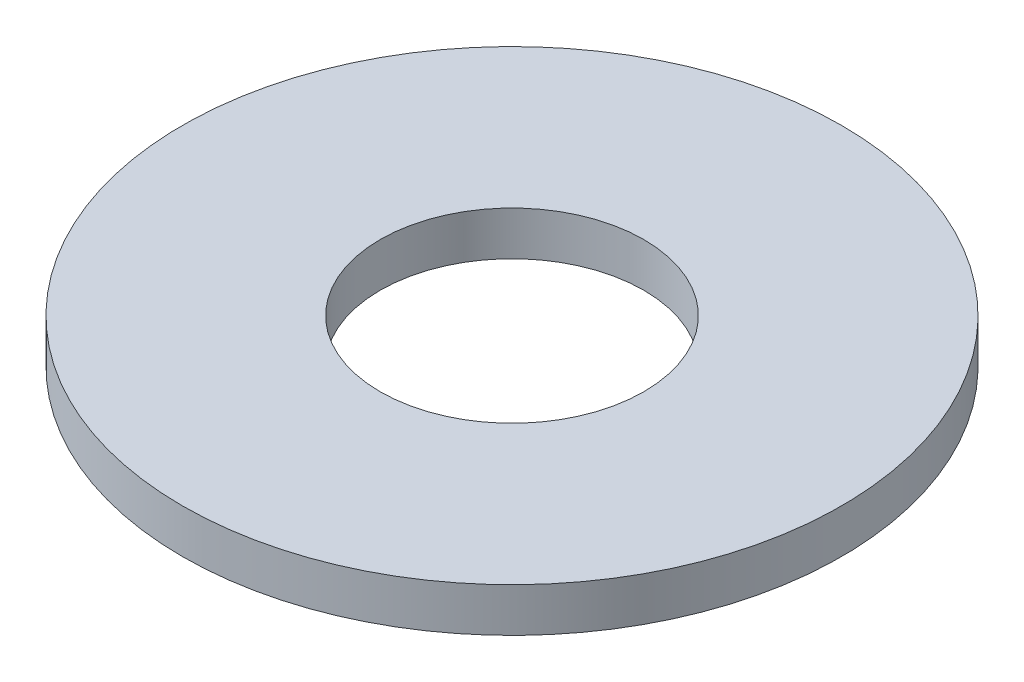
ISO-10303-21;
HEADER;
FILE_DESCRIPTION(('STEP AP214'),'2;1');
FILE_NAME('part.step','',(''),(''),'','','');
FILE_SCHEMA(('AUTOMOTIVE_DESIGN { 1 0 10303 214 1 1 1 1 }'));
ENDSEC;
DATA;
#1=APPLICATION_CONTEXT('core data for automotive mechanical design processes');
#2=APPLICATION_PROTOCOL_DEFINITION('international standard','automotive_design',2000,#1);
#3=PRODUCT_CONTEXT('',#1,'mechanical');
#4=PRODUCT('Part','Part','',(#3));
#5=PRODUCT_RELATED_PRODUCT_CATEGORY('part','',(#4));
#6=PRODUCT_DEFINITION_FORMATION('','',#4);
#7=PRODUCT_DEFINITION_CONTEXT('part definition',#1,'design');
#8=PRODUCT_DEFINITION('design','',#6,#7);
#9=PRODUCT_DEFINITION_SHAPE('','',#8);
#10=(LENGTH_UNIT() NAMED_UNIT(*) SI_UNIT(.MILLI.,.METRE.));
#11=(NAMED_UNIT(*) PLANE_ANGLE_UNIT() SI_UNIT($,.RADIAN.));
#12=(NAMED_UNIT(*) SI_UNIT($,.STERADIAN.) SOLID_ANGLE_UNIT());
#13=UNCERTAINTY_MEASURE_WITH_UNIT(LENGTH_MEASURE(1.E-05),#10,'distance_accuracy_value','');
#14=(GEOMETRIC_REPRESENTATION_CONTEXT(3) GLOBAL_UNCERTAINTY_ASSIGNED_CONTEXT((#13)) GLOBAL_UNIT_ASSIGNED_CONTEXT((#10,
#11,#12)) REPRESENTATION_CONTEXT('',''));
#15=CARTESIAN_POINT('',(0.,0.,0.));
#16=DIRECTION('',(0.,0.,1.));
#17=DIRECTION('',(1.,0.,0.));
#18=AXIS2_PLACEMENT_3D('',#15,#16,#17);
#19=CARTESIAN_POINT('',(0.,0.,0.));
#20=DIRECTION('',(0.,-1.,0.));
#21=DIRECTION('',(0.,0.,-1.));
#22=AXIS2_PLACEMENT_3D('',#19,#20,#21);
#23=CYLINDRICAL_SURFACE('',#22,6.);
#24=CARTESIAN_POINT('',(0.,2.,0.));
#25=DIRECTION('',(0.,-1.,0.));
#26=DIRECTION('',(0.,0.,-1.));
#27=AXIS2_PLACEMENT_3D('',#24,#25,#26);
#28=CIRCLE('',#27,6.);
#29=CARTESIAN_POINT('',(0.,2.,-6.));
#30=VERTEX_POINT('',#29);
#31=EDGE_CURVE('E10',#30,#30,#28,.T.);
#32=ORIENTED_EDGE('',*,*,#31,.F.);
#33=EDGE_LOOP('',(#32));
#34=FACE_BOUND('',#33,.T.);
#35=CARTESIAN_POINT('',(0.,0.,0.));
#36=DIRECTION('',(0.,-1.,0.));
#37=DIRECTION('',(0.,0.,-1.));
#38=AXIS2_PLACEMENT_3D('',#35,#36,#37);
#39=CIRCLE('',#38,6.);
#40=CARTESIAN_POINT('',(0.,0.,-6.));
#41=VERTEX_POINT('',#40);
#42=EDGE_CURVE('E370',#41,#41,#39,.T.);
#43=ORIENTED_EDGE('',*,*,#42,.T.);
#44=EDGE_LOOP('',(#43));
#45=FACE_BOUND('',#44,.T.);
#46=ADVANCED_FACE('F348',(#34,#45),#23,.F.);
#47=CARTESIAN_POINT('',(-6.,2.,0.));
#48=DIRECTION('',(0.,-1.,0.));
#49=DIRECTION('',(0.,0.,-1.));
#50=AXIS2_PLACEMENT_3D('',#47,#48,#49);
#51=PLANE('',#50);
#52=CARTESIAN_POINT('',(0.,2.,0.));
#53=DIRECTION('',(0.,-1.,0.));
#54=DIRECTION('',(0.,0.,-1.));
#55=AXIS2_PLACEMENT_3D('',#52,#53,#54);
#56=CIRCLE('',#55,15.);
#57=CARTESIAN_POINT('',(0.,2.,-15.));
#58=VERTEX_POINT('',#57);
#59=EDGE_CURVE('E354',#58,#58,#56,.T.);
#60=ORIENTED_EDGE('',*,*,#59,.F.);
#61=EDGE_LOOP('',(#60));
#62=FACE_BOUND('',#61,.T.);
#63=ORIENTED_EDGE('',*,*,#31,.T.);
#64=EDGE_LOOP('',(#63));
#65=FACE_BOUND('',#64,.T.);
#66=ADVANCED_FACE('F395',(#62,#65),#51,.F.);
#67=CARTESIAN_POINT('',(0.,0.,0.));
#68=DIRECTION('',(0.,-1.,0.));
#69=DIRECTION('',(0.,0.,-1.));
#70=AXIS2_PLACEMENT_3D('',#67,#68,#69);
#71=CYLINDRICAL_SURFACE('',#70,15.);
#72=CARTESIAN_POINT('',(0.,0.,0.));
#73=DIRECTION('',(0.,-1.,0.));
#74=DIRECTION('',(0.,0.,-1.));
#75=AXIS2_PLACEMENT_3D('',#72,#73,#74);
#76=CIRCLE('',#75,15.);
#77=CARTESIAN_POINT('',(0.,0.,-15.));
#78=VERTEX_POINT('',#77);
#79=EDGE_CURVE('E358',#78,#78,#76,.T.);
#80=ORIENTED_EDGE('',*,*,#79,.F.);
#81=EDGE_LOOP('',(#80));
#82=FACE_BOUND('',#81,.T.);
#83=ORIENTED_EDGE('',*,*,#59,.T.);
#84=EDGE_LOOP('',(#83));
#85=FACE_BOUND('',#84,.T.);
#86=ADVANCED_FACE('F390',(#82,#85),#71,.T.);
#87=CARTESIAN_POINT('',(-12.5,0.,0.));
#88=DIRECTION('',(0.,1.,0.));
#89=DIRECTION('',(0.,0.,1.));
#90=AXIS2_PLACEMENT_3D('',#87,#88,#89);
#91=PLANE('',#90);
#92=CARTESIAN_POINT('',(0.,0.,0.));
#93=DIRECTION('',(0.,-1.,0.));
#94=DIRECTION('',(0.,0.,-1.));
#95=AXIS2_PLACEMENT_3D('',#92,#93,#94);
#96=CIRCLE('',#95,12.5);
#97=CARTESIAN_POINT('',(0.,0.,-12.5));
#98=VERTEX_POINT('',#97);
#99=EDGE_CURVE('E362',#98,#98,#96,.T.);
#100=ORIENTED_EDGE('',*,*,#99,.F.);
#101=EDGE_LOOP('',(#100));
#102=FACE_BOUND('',#101,.T.);
#103=ORIENTED_EDGE('',*,*,#79,.T.);
#104=EDGE_LOOP('',(#103));
#105=FACE_BOUND('',#104,.T.);
#106=ADVANCED_FACE('F384',(#102,#105),#91,.F.);
#107=CARTESIAN_POINT('',(0.,-2.,0.));
#108=DIRECTION('',(0.,-1.,0.));
#109=DIRECTION('',(0.,0.,-1.));
#110=AXIS2_PLACEMENT_3D('',#107,#108,#109);
#111=TOROIDAL_SURFACE('',#110,11.,2.5);
#112=CARTESIAN_POINT('',(0.,0.,0.));
#113=DIRECTION('',(0.,-1.,0.));
#114=DIRECTION('',(0.,0.,-1.));
#115=AXIS2_PLACEMENT_3D('',#112,#113,#114);
#116=CIRCLE('',#115,9.5);
#117=CARTESIAN_POINT('',(0.,0.,-9.5));
#118=VERTEX_POINT('',#117);
#119=EDGE_CURVE('E367',#118,#118,#116,.T.);
#120=ORIENTED_EDGE('',*,*,#119,.F.);
#121=EDGE_LOOP('',(#120));
#122=FACE_BOUND('',#121,.T.);
#123=ORIENTED_EDGE('',*,*,#99,.T.);
#124=EDGE_LOOP('',(#123));
#125=FACE_BOUND('',#124,.T.);
#126=ADVANCED_FACE('F378',(#122,#125),#111,.F.);
#127=CARTESIAN_POINT('',(-6.,0.,0.));
#128=DIRECTION('',(0.,1.,0.));
#129=DIRECTION('',(0.,0.,1.));
#130=AXIS2_PLACEMENT_3D('',#127,#128,#129);
#131=PLANE('',#130);
#132=ORIENTED_EDGE('',*,*,#42,.F.);
#133=EDGE_LOOP('',(#132));
#134=FACE_BOUND('',#133,.T.);
#135=ORIENTED_EDGE('',*,*,#119,.T.);
#136=EDGE_LOOP('',(#135));
#137=FACE_BOUND('',#136,.T.);
#138=ADVANCED_FACE('F375',(#134,#137),#131,.F.);
#139=CLOSED_SHELL('',(#46,#66,#86,#106,#126,#138));
#140=MANIFOLD_SOLID_BREP('B2',#139);
#141=ADVANCED_BREP_SHAPE_REPRESENTATION('',(#18,#140),#14);
#142=SHAPE_DEFINITION_REPRESENTATION(#9,#141);
ENDSEC;
END-ISO-10303-21;
